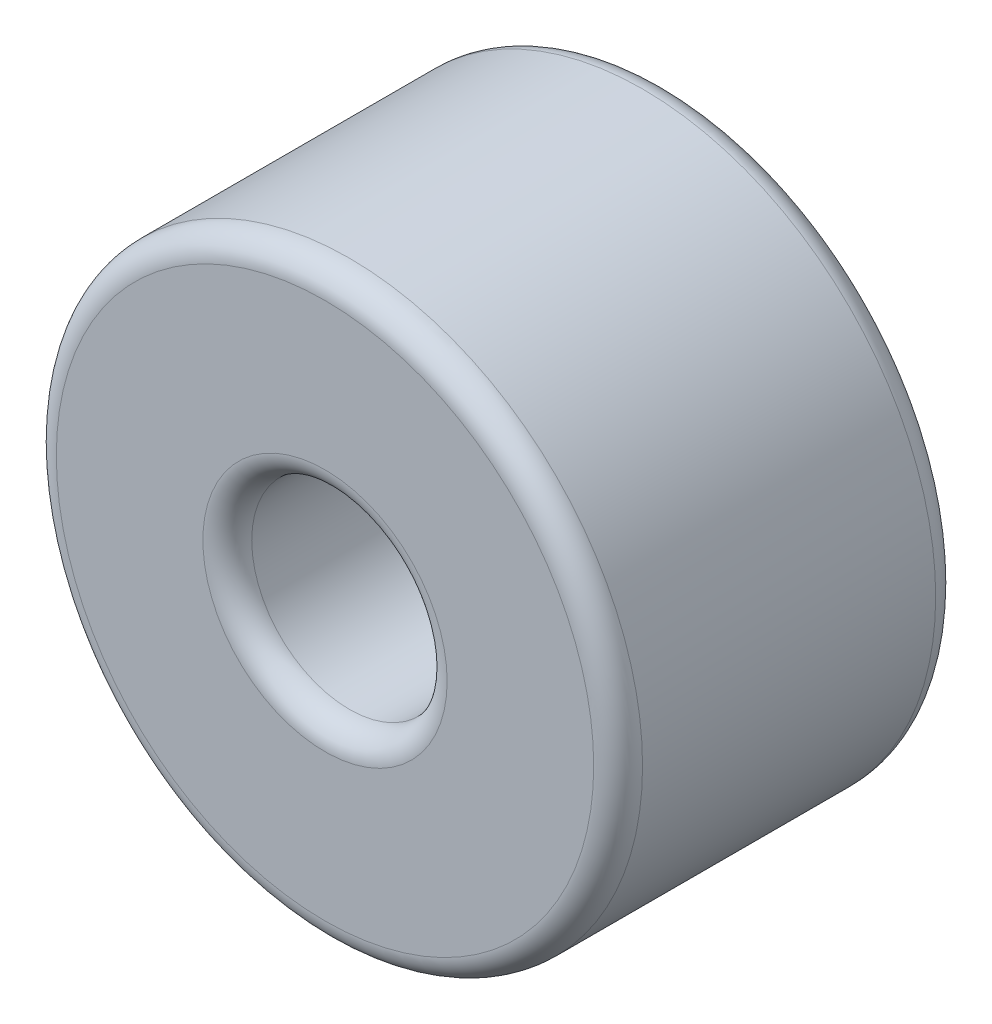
ISO-10303-21;
HEADER;
FILE_DESCRIPTION(('STEP AP214'),'2;1');
FILE_NAME('part.step','',(''),(''),'','','');
FILE_SCHEMA(('AUTOMOTIVE_DESIGN { 1 0 10303 214 1 1 1 1 }'));
ENDSEC;
DATA;
#1=APPLICATION_CONTEXT('core data for automotive mechanical design processes');
#2=APPLICATION_PROTOCOL_DEFINITION('international standard','automotive_design',2000,#1);
#3=PRODUCT_CONTEXT('',#1,'mechanical');
#4=PRODUCT('Part','Part','',(#3));
#5=PRODUCT_RELATED_PRODUCT_CATEGORY('part','',(#4));
#6=PRODUCT_DEFINITION_FORMATION('','',#4);
#7=PRODUCT_DEFINITION_CONTEXT('part definition',#1,'design');
#8=PRODUCT_DEFINITION('design','',#6,#7);
#9=PRODUCT_DEFINITION_SHAPE('','',#8);
#10=(LENGTH_UNIT() NAMED_UNIT(*) SI_UNIT(.MILLI.,.METRE.));
#11=(NAMED_UNIT(*) PLANE_ANGLE_UNIT() SI_UNIT($,.RADIAN.));
#12=(NAMED_UNIT(*) SI_UNIT($,.STERADIAN.) SOLID_ANGLE_UNIT());
#13=UNCERTAINTY_MEASURE_WITH_UNIT(LENGTH_MEASURE(1.E-05),#10,'distance_accuracy_value','');
#14=(GEOMETRIC_REPRESENTATION_CONTEXT(3) GLOBAL_UNCERTAINTY_ASSIGNED_CONTEXT((#13)) GLOBAL_UNIT_ASSIGNED_CONTEXT((#10,
#11,#12)) REPRESENTATION_CONTEXT('',''));
#15=CARTESIAN_POINT('',(0.,0.,0.));
#16=DIRECTION('',(0.,0.,1.));
#17=DIRECTION('',(1.,0.,0.));
#18=AXIS2_PLACEMENT_3D('',#15,#16,#17);
#19=CARTESIAN_POINT('',(0.,0.,6.99999999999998));
#20=DIRECTION('',(0.,0.,0.999999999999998));
#21=DIRECTION('',(0.999999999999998,0.,0.));
#22=AXIS2_PLACEMENT_3D('',#19,#20,#21);
#23=PLANE('',#22);
#24=CARTESIAN_POINT('',(0.,0.,6.99999999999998));
#25=DIRECTION('',(0.,0.,0.999999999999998));
#26=DIRECTION('',(0.999999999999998,0.,0.));
#27=AXIS2_PLACEMENT_3D('',#24,#25,#26);
#28=CIRCLE('',#27,5.);
#29=CARTESIAN_POINT('',(4.99999999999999,0.,6.99999999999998));
#30=VERTEX_POINT('',#29);
#31=EDGE_CURVE('E10',#30,#30,#28,.F.);
#32=ORIENTED_EDGE('',*,*,#31,.T.);
#33=EDGE_LOOP('',(#32));
#34=FACE_BOUND('',#33,.T.);
#35=CARTESIAN_POINT('',(0.,0.,6.99999999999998));
#36=DIRECTION('',(0.,0.,0.999999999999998));
#37=DIRECTION('',(0.999999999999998,0.,0.));
#38=AXIS2_PLACEMENT_3D('',#35,#36,#37);
#39=CIRCLE('',#38,11.);
#40=CARTESIAN_POINT('',(11.,0.,6.99999999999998));
#41=VERTEX_POINT('',#40);
#42=EDGE_CURVE('E49',#41,#41,#39,.T.);
#43=ORIENTED_EDGE('',*,*,#42,.T.);
#44=EDGE_LOOP('',(#43));
#45=FACE_BOUND('',#44,.T.);
#46=ADVANCED_FACE('F29',(#34,#45),#23,.T.);
#47=CARTESIAN_POINT('',(0.,0.,-6.99999999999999));
#48=DIRECTION('',(0.,0.,0.999999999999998));
#49=DIRECTION('',(0.999999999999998,0.,0.));
#50=AXIS2_PLACEMENT_3D('',#47,#48,#49);
#51=PLANE('',#50);
#52=CARTESIAN_POINT('',(0.,0.,-6.99999999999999));
#53=DIRECTION('',(0.,0.,0.999999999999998));
#54=DIRECTION('',(0.999999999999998,0.,0.));
#55=AXIS2_PLACEMENT_3D('',#52,#53,#54);
#56=CIRCLE('',#55,5.);
#57=CARTESIAN_POINT('',(4.99999999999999,0.,-6.99999999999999));
#58=VERTEX_POINT('',#57);
#59=EDGE_CURVE('E44',#58,#58,#56,.T.);
#60=ORIENTED_EDGE('',*,*,#59,.T.);
#61=EDGE_LOOP('',(#60));
#62=FACE_BOUND('',#61,.T.);
#63=CARTESIAN_POINT('',(0.,0.,-6.99999999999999));
#64=DIRECTION('',(0.,0.,0.999999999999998));
#65=DIRECTION('',(0.999999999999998,0.,0.));
#66=AXIS2_PLACEMENT_3D('',#63,#64,#65);
#67=CIRCLE('',#66,11.);
#68=CARTESIAN_POINT('',(11.,0.,-6.99999999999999));
#69=VERTEX_POINT('',#68);
#70=EDGE_CURVE('E52',#69,#69,#67,.F.);
#71=ORIENTED_EDGE('',*,*,#70,.T.);
#72=EDGE_LOOP('',(#71));
#73=FACE_BOUND('',#72,.T.);
#74=ADVANCED_FACE('F73',(#62,#73),#51,.F.);
#75=CARTESIAN_POINT('',(0.,0.,6.99999999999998));
#76=DIRECTION('',(0.,0.,-0.999999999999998));
#77=DIRECTION('',(-0.999999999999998,0.,0.));
#78=AXIS2_PLACEMENT_3D('',#75,#76,#77);
#79=CYLINDRICAL_SURFACE('',#78,12.);
#80=CARTESIAN_POINT('',(0.,0.,-6.));
#81=DIRECTION('',(0.,0.,0.999999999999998));
#82=DIRECTION('',(0.999999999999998,0.,0.));
#83=AXIS2_PLACEMENT_3D('',#80,#81,#82);
#84=CIRCLE('',#83,12.);
#85=CARTESIAN_POINT('',(-12.,0.,-6.));
#86=VERTEX_POINT('',#85);
#87=EDGE_CURVE('E55',#86,#86,#84,.T.);
#88=CARTESIAN_POINT('',(0.,0.,5.99999999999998));
#89=DIRECTION('',(0.,0.,0.999999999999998));
#90=DIRECTION('',(0.999999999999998,0.,0.));
#91=AXIS2_PLACEMENT_3D('',#88,#89,#90);
#92=CIRCLE('',#91,12.);
#93=CARTESIAN_POINT('',(-12.,0.,5.99999999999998));
#94=VERTEX_POINT('',#93);
#95=EDGE_CURVE('E58',#94,#94,#92,.F.);
#96=CARTESIAN_POINT('',(-12.,0.,-6.));
#97=CARTESIAN_POINT('',(-12.,0.,-5.875));
#98=CARTESIAN_POINT('',(-12.,0.,-5.75));
#99=CARTESIAN_POINT('',(-12.,0.,-5.5));
#100=CARTESIAN_POINT('',(-12.,0.,-5.375));
#101=CARTESIAN_POINT('',(-12.,0.,-5.125));
#102=CARTESIAN_POINT('',(-12.,0.,-5.));
#103=CARTESIAN_POINT('',(-12.,0.,-4.75));
#104=CARTESIAN_POINT('',(-12.,0.,-4.625));
#105=CARTESIAN_POINT('',(-12.,0.,-4.375));
#106=CARTESIAN_POINT('',(-12.,0.,-4.25));
#107=CARTESIAN_POINT('',(-12.,0.,-4.));
#108=CARTESIAN_POINT('',(-12.,0.,-3.875));
#109=CARTESIAN_POINT('',(-12.,0.,-3.62500000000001));
#110=CARTESIAN_POINT('',(-12.,0.,-3.50000000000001));
#111=CARTESIAN_POINT('',(-12.,0.,-3.25000000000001));
#112=CARTESIAN_POINT('',(-12.,0.,-3.12500000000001));
#113=CARTESIAN_POINT('',(-12.,0.,-2.87500000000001));
#114=CARTESIAN_POINT('',(-12.,0.,-2.75000000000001));
#115=CARTESIAN_POINT('',(-12.,0.,-2.50000000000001));
#116=CARTESIAN_POINT('',(-12.,0.,-2.37500000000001));
#117=CARTESIAN_POINT('',(-12.,0.,-2.12500000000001));
#118=CARTESIAN_POINT('',(-12.,0.,-2.00000000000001));
#119=CARTESIAN_POINT('',(-12.,0.,-1.75000000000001));
#120=CARTESIAN_POINT('',(-12.,0.,-1.62500000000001));
#121=CARTESIAN_POINT('',(-12.,0.,-1.37500000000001));
#122=CARTESIAN_POINT('',(-12.,0.,-1.25000000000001));
#123=CARTESIAN_POINT('',(-12.,0.,-1.00000000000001));
#124=CARTESIAN_POINT('',(-12.,0.,-0.875000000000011));
#125=CARTESIAN_POINT('',(-12.,0.,-0.625000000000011));
#126=CARTESIAN_POINT('',(-12.,0.,-0.500000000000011));
#127=CARTESIAN_POINT('',(-12.,0.,-0.250000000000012));
#128=CARTESIAN_POINT('',(-12.,0.,-0.125000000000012));
#129=CARTESIAN_POINT('',(-12.,0.,0.124999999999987));
#130=CARTESIAN_POINT('',(-12.,0.,0.249999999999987));
#131=CARTESIAN_POINT('',(-12.,0.,0.499999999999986));
#132=CARTESIAN_POINT('',(-12.,0.,0.624999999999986));
#133=CARTESIAN_POINT('',(-12.,0.,0.874999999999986));
#134=CARTESIAN_POINT('',(-12.,0.,0.999999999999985));
#135=CARTESIAN_POINT('',(-12.,0.,1.24999999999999));
#136=CARTESIAN_POINT('',(-12.,0.,1.37499999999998));
#137=CARTESIAN_POINT('',(-12.,0.,1.62499999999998));
#138=CARTESIAN_POINT('',(-12.,0.,1.74999999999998));
#139=CARTESIAN_POINT('',(-12.,0.,1.99999999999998));
#140=CARTESIAN_POINT('',(-12.,0.,2.12499999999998));
#141=CARTESIAN_POINT('',(-12.,0.,2.37499999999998));
#142=CARTESIAN_POINT('',(-12.,0.,2.49999999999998));
#143=CARTESIAN_POINT('',(-12.,0.,2.74999999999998));
#144=CARTESIAN_POINT('',(-12.,0.,2.87499999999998));
#145=CARTESIAN_POINT('',(-12.,0.,3.12499999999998));
#146=CARTESIAN_POINT('',(-12.,0.,3.24999999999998));
#147=CARTESIAN_POINT('',(-12.,0.,3.49999999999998));
#148=CARTESIAN_POINT('',(-12.,0.,3.62499999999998));
#149=CARTESIAN_POINT('',(-12.,0.,3.87499999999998));
#150=CARTESIAN_POINT('',(-12.,0.,3.99999999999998));
#151=CARTESIAN_POINT('',(-12.,0.,4.24999999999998));
#152=CARTESIAN_POINT('',(-12.,0.,4.37499999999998));
#153=CARTESIAN_POINT('',(-12.,0.,4.62499999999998));
#154=CARTESIAN_POINT('',(-12.,0.,4.74999999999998));
#155=CARTESIAN_POINT('',(-12.,0.,4.99999999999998));
#156=CARTESIAN_POINT('',(-12.,0.,5.12499999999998));
#157=CARTESIAN_POINT('',(-12.,0.,5.37499999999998));
#158=CARTESIAN_POINT('',(-12.,0.,5.49999999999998));
#159=CARTESIAN_POINT('',(-12.,0.,5.74999999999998));
#160=CARTESIAN_POINT('',(-12.,0.,5.87499999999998));
#161=CARTESIAN_POINT('',(-12.,0.,5.99999999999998));
#162=B_SPLINE_CURVE_WITH_KNOTS('',3,(#96,#97,#98,#99,#100,#101,#102,#103,#104,#105,#106,#107,
#108,#109,#110,#111,#112,#113,#114,#115,#116,#117,#118,#119,#120,#121,#122,#123,#124,#125,#126,
#127,#128,#129,#130,#131,#132,#133,#134,#135,#136,#137,#138,#139,#140,#141,#142,#143,#144,#145,
#146,#147,#148,#149,#150,#151,#152,#153,#154,#155,#156,#157,#158,#159,#160,#161),.UNSPECIFIED.,
.F.,.F.,(4,2,2,2,2,2,2,2,2,2,2,2,2,2,2,2,2,2,2,2,2,2,2,2,2,2,2,2,2,2,2,2,4),(0.,
0.374999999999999,0.749999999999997,1.125,1.5,1.875,2.25,2.62499999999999,2.99999999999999,
3.37499999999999,3.74999999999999,4.12499999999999,4.49999999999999,4.87499999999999,
5.24999999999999,5.62499999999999,5.99999999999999,6.37499999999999,6.74999999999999,
7.12499999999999,7.49999999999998,7.87499999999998,8.24999999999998,8.62499999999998,
8.99999999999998,9.37499999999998,9.74999999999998,10.125,10.5,10.875,11.25,11.625,12.),.UNSPECIFIED.);
#163=EDGE_CURVE('BSEAM62',#86,#94,#162,.T.);
#164=ORIENTED_EDGE('',*,*,#87,.T.);
#165=ORIENTED_EDGE('',*,*,#95,.T.);
#166=ORIENTED_EDGE('',*,*,#163,.T.);
#167=ORIENTED_EDGE('',*,*,#163,.F.);
#168=EDGE_LOOP('',(#164,#166,#165,#167));
#169=FACE_BOUND('',#168,.T.);
#170=ADVANCED_FACE('F62',(#169),#79,.T.);
#171=CARTESIAN_POINT('',(0.,0.,6.99999999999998));
#172=DIRECTION('',(0.,0.,-0.999999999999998));
#173=DIRECTION('',(-0.999999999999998,0.,0.));
#174=AXIS2_PLACEMENT_3D('',#171,#172,#173);
#175=CYLINDRICAL_SURFACE('',#174,4.);
#176=CARTESIAN_POINT('',(0.,0.,-6.));
#177=DIRECTION('',(0.,0.,0.999999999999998));
#178=DIRECTION('',(0.999999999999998,0.,0.));
#179=AXIS2_PLACEMENT_3D('',#176,#177,#178);
#180=CIRCLE('',#179,4.);
#181=CARTESIAN_POINT('',(-3.99999999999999,0.,-6.));
#182=VERTEX_POINT('',#181);
#183=EDGE_CURVE('E36',#182,#182,#180,.F.);
#184=CARTESIAN_POINT('',(0.,0.,5.99999999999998));
#185=DIRECTION('',(0.,0.,0.999999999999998));
#186=DIRECTION('',(0.999999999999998,0.,0.));
#187=AXIS2_PLACEMENT_3D('',#184,#185,#186);
#188=CIRCLE('',#187,4.);
#189=CARTESIAN_POINT('',(-3.99999999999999,0.,5.99999999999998));
#190=VERTEX_POINT('',#189);
#191=EDGE_CURVE('E40',#190,#190,#188,.T.);
#192=CARTESIAN_POINT('',(-3.99999999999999,0.,-6.));
#193=CARTESIAN_POINT('',(-3.99999999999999,0.,-5.875));
#194=CARTESIAN_POINT('',(-3.99999999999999,0.,-5.75));
#195=CARTESIAN_POINT('',(-3.99999999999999,0.,-5.5));
#196=CARTESIAN_POINT('',(-3.99999999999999,0.,-5.375));
#197=CARTESIAN_POINT('',(-3.99999999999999,0.,-5.125));
#198=CARTESIAN_POINT('',(-3.99999999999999,0.,-5.));
#199=CARTESIAN_POINT('',(-3.99999999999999,0.,-4.75));
#200=CARTESIAN_POINT('',(-3.99999999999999,0.,-4.625));
#201=CARTESIAN_POINT('',(-3.99999999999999,0.,-4.375));
#202=CARTESIAN_POINT('',(-3.99999999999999,0.,-4.25));
#203=CARTESIAN_POINT('',(-3.99999999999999,0.,-4.));
#204=CARTESIAN_POINT('',(-3.99999999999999,0.,-3.875));
#205=CARTESIAN_POINT('',(-3.99999999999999,0.,-3.62500000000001));
#206=CARTESIAN_POINT('',(-3.99999999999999,0.,-3.50000000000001));
#207=CARTESIAN_POINT('',(-3.99999999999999,0.,-3.25000000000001));
#208=CARTESIAN_POINT('',(-3.99999999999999,0.,-3.12500000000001));
#209=CARTESIAN_POINT('',(-3.99999999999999,0.,-2.87500000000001));
#210=CARTESIAN_POINT('',(-3.99999999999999,0.,-2.75000000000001));
#211=CARTESIAN_POINT('',(-3.99999999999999,0.,-2.50000000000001));
#212=CARTESIAN_POINT('',(-3.99999999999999,0.,-2.37500000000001));
#213=CARTESIAN_POINT('',(-3.99999999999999,0.,-2.12500000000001));
#214=CARTESIAN_POINT('',(-3.99999999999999,0.,-2.00000000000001));
#215=CARTESIAN_POINT('',(-3.99999999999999,0.,-1.75000000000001));
#216=CARTESIAN_POINT('',(-3.99999999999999,0.,-1.62500000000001));
#217=CARTESIAN_POINT('',(-3.99999999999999,0.,-1.37500000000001));
#218=CARTESIAN_POINT('',(-3.99999999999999,0.,-1.25000000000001));
#219=CARTESIAN_POINT('',(-3.99999999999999,0.,-1.00000000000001));
#220=CARTESIAN_POINT('',(-3.99999999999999,0.,-0.875000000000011));
#221=CARTESIAN_POINT('',(-3.99999999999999,0.,-0.625000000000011));
#222=CARTESIAN_POINT('',(-3.99999999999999,0.,-0.500000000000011));
#223=CARTESIAN_POINT('',(-3.99999999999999,0.,-0.250000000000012));
#224=CARTESIAN_POINT('',(-3.99999999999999,0.,-0.125000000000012));
#225=CARTESIAN_POINT('',(-3.99999999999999,0.,0.124999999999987));
#226=CARTESIAN_POINT('',(-3.99999999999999,0.,0.249999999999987));
#227=CARTESIAN_POINT('',(-3.99999999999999,0.,0.499999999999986));
#228=CARTESIAN_POINT('',(-3.99999999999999,0.,0.624999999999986));
#229=CARTESIAN_POINT('',(-3.99999999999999,0.,0.874999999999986));
#230=CARTESIAN_POINT('',(-3.99999999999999,0.,0.999999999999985));
#231=CARTESIAN_POINT('',(-3.99999999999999,0.,1.24999999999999));
#232=CARTESIAN_POINT('',(-3.99999999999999,0.,1.37499999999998));
#233=CARTESIAN_POINT('',(-3.99999999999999,0.,1.62499999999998));
#234=CARTESIAN_POINT('',(-3.99999999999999,0.,1.74999999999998));
#235=CARTESIAN_POINT('',(-3.99999999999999,0.,1.99999999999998));
#236=CARTESIAN_POINT('',(-3.99999999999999,0.,2.12499999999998));
#237=CARTESIAN_POINT('',(-3.99999999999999,0.,2.37499999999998));
#238=CARTESIAN_POINT('',(-3.99999999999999,0.,2.49999999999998));
#239=CARTESIAN_POINT('',(-3.99999999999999,0.,2.74999999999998));
#240=CARTESIAN_POINT('',(-3.99999999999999,0.,2.87499999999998));
#241=CARTESIAN_POINT('',(-3.99999999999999,0.,3.12499999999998));
#242=CARTESIAN_POINT('',(-3.99999999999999,0.,3.24999999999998));
#243=CARTESIAN_POINT('',(-3.99999999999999,0.,3.49999999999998));
#244=CARTESIAN_POINT('',(-3.99999999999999,0.,3.62499999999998));
#245=CARTESIAN_POINT('',(-3.99999999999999,0.,3.87499999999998));
#246=CARTESIAN_POINT('',(-3.99999999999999,0.,3.99999999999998));
#247=CARTESIAN_POINT('',(-3.99999999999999,0.,4.24999999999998));
#248=CARTESIAN_POINT('',(-3.99999999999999,0.,4.37499999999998));
#249=CARTESIAN_POINT('',(-3.99999999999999,0.,4.62499999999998));
#250=CARTESIAN_POINT('',(-3.99999999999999,0.,4.74999999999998));
#251=CARTESIAN_POINT('',(-3.99999999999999,0.,4.99999999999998));
#252=CARTESIAN_POINT('',(-3.99999999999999,0.,5.12499999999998));
#253=CARTESIAN_POINT('',(-3.99999999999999,0.,5.37499999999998));
#254=CARTESIAN_POINT('',(-3.99999999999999,0.,5.49999999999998));
#255=CARTESIAN_POINT('',(-3.99999999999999,0.,5.74999999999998));
#256=CARTESIAN_POINT('',(-3.99999999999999,0.,5.87499999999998));
#257=CARTESIAN_POINT('',(-3.99999999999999,0.,5.99999999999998));
#258=B_SPLINE_CURVE_WITH_KNOTS('',3,(#192,#193,#194,#195,#196,#197,#198,#199,#200,#201,#202,
#203,#204,#205,#206,#207,#208,#209,#210,#211,#212,#213,#214,#215,#216,#217,#218,#219,#220,#221,
#222,#223,#224,#225,#226,#227,#228,#229,#230,#231,#232,#233,#234,#235,#236,#237,#238,#239,#240,
#241,#242,#243,#244,#245,#246,#247,#248,#249,#250,#251,#252,#253,#254,#255,#256,#257),
.UNSPECIFIED.,.F.,.F.,(4,2,2,2,2,2,2,2,2,2,2,2,2,2,2,2,2,2,2,2,2,2,2,2,2,2,2,2,2,2,2,2,4),(0.,
0.374999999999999,0.749999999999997,1.125,1.5,1.875,2.25,2.62499999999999,2.99999999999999,
3.37499999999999,3.74999999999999,4.12499999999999,4.49999999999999,4.87499999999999,
5.24999999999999,5.62499999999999,5.99999999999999,6.37499999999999,6.74999999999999,
7.12499999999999,7.49999999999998,7.87499999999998,8.24999999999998,8.62499999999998,
8.99999999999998,9.37499999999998,9.74999999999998,10.125,10.5,10.875,11.25,11.625,12.),.UNSPECIFIED.);
#259=EDGE_CURVE('BSEAM81',#182,#190,#258,.T.);
#260=ORIENTED_EDGE('',*,*,#183,.T.);
#261=ORIENTED_EDGE('',*,*,#191,.T.);
#262=ORIENTED_EDGE('',*,*,#259,.T.);
#263=ORIENTED_EDGE('',*,*,#259,.F.);
#264=EDGE_LOOP('',(#260,#262,#261,#263));
#265=FACE_BOUND('',#264,.T.);
#266=ADVANCED_FACE('F81',(#265),#175,.F.);
#267=CARTESIAN_POINT('',(0.,0.,-6.));
#268=DIRECTION('',(0.,0.,0.999999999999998));
#269=DIRECTION('',(0.999999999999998,0.,0.));
#270=AXIS2_PLACEMENT_3D('',#267,#268,#269);
#271=TOROIDAL_SURFACE('',#270,11.,1.);
#272=ORIENTED_EDGE('',*,*,#70,.F.);
#273=EDGE_LOOP('',(#272));
#274=FACE_BOUND('',#273,.T.);
#275=ORIENTED_EDGE('',*,*,#87,.F.);
#276=EDGE_LOOP('',(#275));
#277=FACE_BOUND('',#276,.T.);
#278=ADVANCED_FACE('F68',(#274,#277),#271,.T.);
#279=CARTESIAN_POINT('',(0.,0.,5.99999999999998));
#280=DIRECTION('',(0.,0.,0.999999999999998));
#281=DIRECTION('',(0.999999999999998,0.,0.));
#282=AXIS2_PLACEMENT_3D('',#279,#280,#281);
#283=TOROIDAL_SURFACE('',#282,11.,1.);
#284=ORIENTED_EDGE('',*,*,#95,.F.);
#285=EDGE_LOOP('',(#284));
#286=FACE_BOUND('',#285,.T.);
#287=ORIENTED_EDGE('',*,*,#42,.F.);
#288=EDGE_LOOP('',(#287));
#289=FACE_BOUND('',#288,.T.);
#290=ADVANCED_FACE('F64',(#286,#289),#283,.T.);
#291=CARTESIAN_POINT('',(0.,0.,-6.));
#292=DIRECTION('',(0.,0.,0.999999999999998));
#293=DIRECTION('',(0.999999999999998,0.,0.));
#294=AXIS2_PLACEMENT_3D('',#291,#292,#293);
#295=TOROIDAL_SURFACE('',#294,5.,1.);
#296=ORIENTED_EDGE('',*,*,#183,.F.);
#297=EDGE_LOOP('',(#296));
#298=FACE_BOUND('',#297,.T.);
#299=ORIENTED_EDGE('',*,*,#59,.F.);
#300=EDGE_LOOP('',(#299));
#301=FACE_BOUND('',#300,.T.);
#302=ADVANCED_FACE('F67',(#298,#301),#295,.T.);
#303=CARTESIAN_POINT('',(0.,0.,5.99999999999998));
#304=DIRECTION('',(0.,0.,0.999999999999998));
#305=DIRECTION('',(0.999999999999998,0.,0.));
#306=AXIS2_PLACEMENT_3D('',#303,#304,#305);
#307=TOROIDAL_SURFACE('',#306,5.,1.);
#308=ORIENTED_EDGE('',*,*,#31,.F.);
#309=EDGE_LOOP('',(#308));
#310=FACE_BOUND('',#309,.T.);
#311=ORIENTED_EDGE('',*,*,#191,.F.);
#312=EDGE_LOOP('',(#311));
#313=FACE_BOUND('',#312,.T.);
#314=ADVANCED_FACE('F31',(#310,#313),#307,.T.);
#315=CLOSED_SHELL('',(#46,#74,#170,#266,#278,#290,#302,#314));
#316=MANIFOLD_SOLID_BREP('B2',#315);
#317=ADVANCED_BREP_SHAPE_REPRESENTATION('',(#18,#316),#14);
#318=SHAPE_DEFINITION_REPRESENTATION(#9,#317);
ENDSEC;
END-ISO-10303-21;
